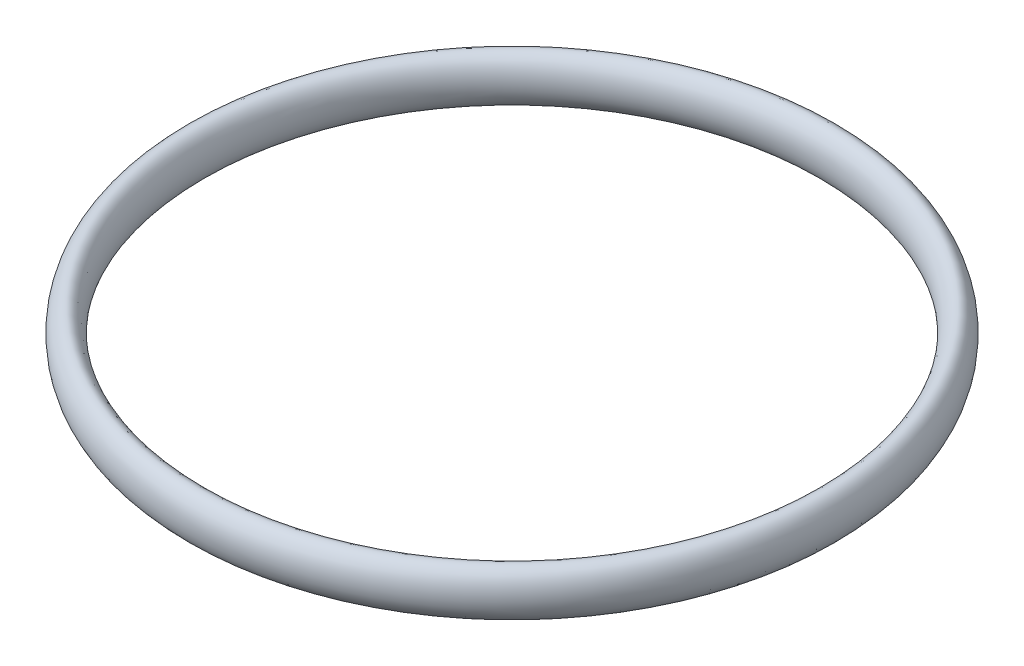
ISO-10303-21;
HEADER;
FILE_DESCRIPTION(('STEP AP214'),'2;1');
FILE_NAME('part.step','',(''),(''),'','','');
FILE_SCHEMA(('AUTOMOTIVE_DESIGN { 1 0 10303 214 1 1 1 1 }'));
ENDSEC;
DATA;
#1=APPLICATION_CONTEXT('core data for automotive mechanical design processes');
#2=APPLICATION_PROTOCOL_DEFINITION('international standard','automotive_design',2000,#1);
#3=PRODUCT_CONTEXT('',#1,'mechanical');
#4=PRODUCT('Part','Part','',(#3));
#5=PRODUCT_RELATED_PRODUCT_CATEGORY('part','',(#4));
#6=PRODUCT_DEFINITION_FORMATION('','',#4);
#7=PRODUCT_DEFINITION_CONTEXT('part definition',#1,'design');
#8=PRODUCT_DEFINITION('design','',#6,#7);
#9=PRODUCT_DEFINITION_SHAPE('','',#8);
#10=(LENGTH_UNIT() NAMED_UNIT(*) SI_UNIT(.MILLI.,.METRE.));
#11=(NAMED_UNIT(*) PLANE_ANGLE_UNIT() SI_UNIT($,.RADIAN.));
#12=(NAMED_UNIT(*) SI_UNIT($,.STERADIAN.) SOLID_ANGLE_UNIT());
#13=UNCERTAINTY_MEASURE_WITH_UNIT(LENGTH_MEASURE(1.E-05),#10,'distance_accuracy_value','');
#14=(GEOMETRIC_REPRESENTATION_CONTEXT(3) GLOBAL_UNCERTAINTY_ASSIGNED_CONTEXT((#13)) GLOBAL_UNIT_ASSIGNED_CONTEXT((#10,
#11,#12)) REPRESENTATION_CONTEXT('',''));
#15=CARTESIAN_POINT('',(0.,0.,0.));
#16=DIRECTION('',(0.,0.,1.));
#17=DIRECTION('',(1.,0.,0.));
#18=AXIS2_PLACEMENT_3D('',#15,#16,#17);
#19=CARTESIAN_POINT('',(-47.825,-3.55,0.));
#20=DIRECTION('',(0.,0.,1.));
#21=DIRECTION('',(0.,1.,0.));
#22=AXIS2_PLACEMENT_3D('',#19,#20,#21);
#23=ELLIPSE('',#22,3.55,2.175);
#24=CARTESIAN_POINT('',(0.,51.6737551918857,0.));
#25=DIRECTION('',(0.,1.,0.));
#26=AXIS1_PLACEMENT('',#24,#25);
#27=SURFACE_OF_REVOLUTION('',#23,#26);
#28=ADVANCED_FACE('F439',(),#27,.F.);
#29=CLOSED_SHELL('',(#28));
#30=MANIFOLD_SOLID_BREP('B2',#29);
#31=ADVANCED_BREP_SHAPE_REPRESENTATION('',(#18,#30),#14);
#32=SHAPE_DEFINITION_REPRESENTATION(#9,#31);
ENDSEC;
END-ISO-10303-21;
